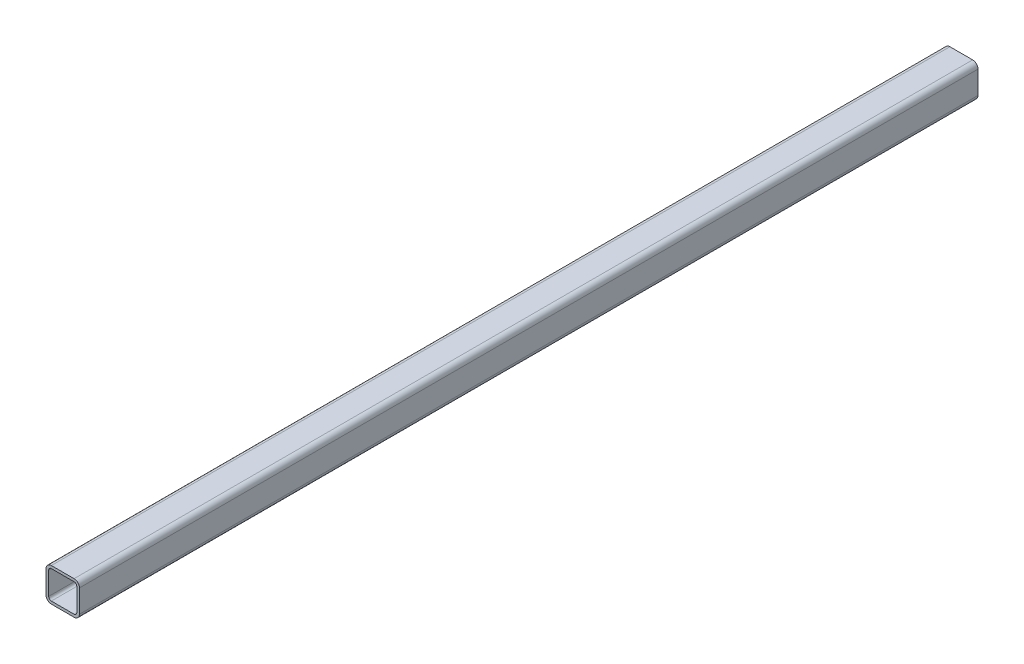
ISO-10303-21;
HEADER;
FILE_DESCRIPTION(('STEP AP214'),'2;1');
FILE_NAME('part.step','',(''),(''),'','','');
FILE_SCHEMA(('AUTOMOTIVE_DESIGN { 1 0 10303 214 1 1 1 1 }'));
ENDSEC;
DATA;
#1=APPLICATION_CONTEXT('core data for automotive mechanical design processes');
#2=APPLICATION_PROTOCOL_DEFINITION('international standard','automotive_design',2000,#1);
#3=PRODUCT_CONTEXT('',#1,'mechanical');
#4=PRODUCT('Part','Part','',(#3));
#5=PRODUCT_RELATED_PRODUCT_CATEGORY('part','',(#4));
#6=PRODUCT_DEFINITION_FORMATION('','',#4);
#7=PRODUCT_DEFINITION_CONTEXT('part definition',#1,'design');
#8=PRODUCT_DEFINITION('design','',#6,#7);
#9=PRODUCT_DEFINITION_SHAPE('','',#8);
#10=(LENGTH_UNIT() NAMED_UNIT(*) SI_UNIT(.MILLI.,.METRE.));
#11=(NAMED_UNIT(*) PLANE_ANGLE_UNIT() SI_UNIT($,.RADIAN.));
#12=(NAMED_UNIT(*) SI_UNIT($,.STERADIAN.) SOLID_ANGLE_UNIT());
#13=UNCERTAINTY_MEASURE_WITH_UNIT(LENGTH_MEASURE(1.E-05),#10,'distance_accuracy_value','');
#14=(GEOMETRIC_REPRESENTATION_CONTEXT(3) GLOBAL_UNCERTAINTY_ASSIGNED_CONTEXT((#13)) GLOBAL_UNIT_ASSIGNED_CONTEXT((#10,
#11,#12)) REPRESENTATION_CONTEXT('',''));
#15=CARTESIAN_POINT('',(0.,0.,0.));
#16=DIRECTION('',(0.,0.,1.));
#17=DIRECTION('',(1.,0.,0.));
#18=AXIS2_PLACEMENT_3D('',#15,#16,#17);
#19=CARTESIAN_POINT('',(-12.97432,12.97432,511.96875));
#20=DIRECTION('',(0.,0.,1.));
#21=DIRECTION('',(1.,0.,0.));
#22=AXIS2_PLACEMENT_3D('',#19,#20,#21);
#23=PLANE('',#22);
#24=CARTESIAN_POINT('',(-12.97432,12.97432,511.96875));
#25=DIRECTION('',(0.,0.,1.));
#26=DIRECTION('',(-1.,0.,0.));
#27=AXIS2_PLACEMENT_3D('',#24,#25,#26);
#28=CIRCLE('',#27,6.07568);
#29=CARTESIAN_POINT('',(-12.97432,19.05,511.96875));
#30=VERTEX_POINT('',#29);
#31=CARTESIAN_POINT('',(-19.05,12.97432,511.96875));
#32=VERTEX_POINT('',#31);
#33=EDGE_CURVE('E260',#30,#32,#28,.T.);
#34=ORIENTED_EDGE('',*,*,#33,.T.);
#35=DIRECTION('',(0.,-1.,0.));
#36=VECTOR('',#35,1.);
#37=CARTESIAN_POINT('',(-19.05,12.97432,511.96875));
#38=LINE('',#37,#36);
#39=CARTESIAN_POINT('',(-19.05,-12.97432,511.96875));
#40=VERTEX_POINT('',#39);
#41=EDGE_CURVE('E263',#32,#40,#38,.T.);
#42=ORIENTED_EDGE('',*,*,#41,.T.);
#43=CARTESIAN_POINT('',(-12.97432,-12.97432,511.96875));
#44=DIRECTION('',(0.,0.,1.));
#45=DIRECTION('',(-1.,0.,0.));
#46=AXIS2_PLACEMENT_3D('',#43,#44,#45);
#47=CIRCLE('',#46,6.07568);
#48=CARTESIAN_POINT('',(-12.97432,-19.05,511.96875));
#49=VERTEX_POINT('',#48);
#50=EDGE_CURVE('E266',#40,#49,#47,.T.);
#51=ORIENTED_EDGE('',*,*,#50,.T.);
#52=DIRECTION('',(1.,0.,0.));
#53=VECTOR('',#52,1.);
#54=CARTESIAN_POINT('',(-12.97432,-19.05,511.96875));
#55=LINE('',#54,#53);
#56=CARTESIAN_POINT('',(12.97432,-19.05,511.96875));
#57=VERTEX_POINT('',#56);
#58=EDGE_CURVE('E268',#49,#57,#55,.T.);
#59=ORIENTED_EDGE('',*,*,#58,.T.);
#60=CARTESIAN_POINT('',(12.97432,-12.97432,511.96875));
#61=DIRECTION('',(0.,0.,1.));
#62=DIRECTION('',(1.,0.,0.));
#63=AXIS2_PLACEMENT_3D('',#60,#61,#62);
#64=CIRCLE('',#63,6.07568);
#65=CARTESIAN_POINT('',(19.05,-12.97432,511.96875));
#66=VERTEX_POINT('',#65);
#67=EDGE_CURVE('E270',#57,#66,#64,.T.);
#68=ORIENTED_EDGE('',*,*,#67,.T.);
#69=DIRECTION('',(0.,1.,0.));
#70=VECTOR('',#69,1.);
#71=CARTESIAN_POINT('',(19.05,12.97432,511.96875));
#72=LINE('',#71,#70);
#73=CARTESIAN_POINT('',(19.05,12.97432,511.96875));
#74=VERTEX_POINT('',#73);
#75=EDGE_CURVE('E272',#66,#74,#72,.T.);
#76=ORIENTED_EDGE('',*,*,#75,.T.);
#77=CARTESIAN_POINT('',(12.97432,12.97432,511.96875));
#78=DIRECTION('',(0.,0.,1.));
#79=DIRECTION('',(1.,0.,0.));
#80=AXIS2_PLACEMENT_3D('',#77,#78,#79);
#81=CIRCLE('',#80,6.07568);
#82=CARTESIAN_POINT('',(12.97432,19.05,511.96875));
#83=VERTEX_POINT('',#82);
#84=EDGE_CURVE('E274',#74,#83,#81,.T.);
#85=ORIENTED_EDGE('',*,*,#84,.T.);
#86=DIRECTION('',(-1.,0.,0.));
#87=VECTOR('',#86,1.);
#88=CARTESIAN_POINT('',(-12.97432,19.05,511.96875));
#89=LINE('',#88,#87);
#90=EDGE_CURVE('E276',#83,#30,#89,.T.);
#91=ORIENTED_EDGE('',*,*,#90,.T.);
#92=EDGE_LOOP('',(#34,#42,#51,#59,#68,#76,#85,#91));
#93=FACE_BOUND('',#92,.T.);
#94=DIRECTION('',(0.,-1.,0.));
#95=VECTOR('',#94,1.);
#96=CARTESIAN_POINT('',(-16.01216,12.97432,511.96875));
#97=LINE('',#96,#95);
#98=CARTESIAN_POINT('',(-16.01216,12.97432,511.96875));
#99=VERTEX_POINT('',#98);
#100=CARTESIAN_POINT('',(-16.01216,-12.97432,511.96875));
#101=VERTEX_POINT('',#100);
#102=EDGE_CURVE('E203',#99,#101,#97,.T.);
#103=ORIENTED_EDGE('',*,*,#102,.F.);
#104=CARTESIAN_POINT('',(-12.97432,12.97432,511.96875));
#105=DIRECTION('',(0.,0.,-1.));
#106=DIRECTION('',(-1.,0.,0.));
#107=AXIS2_PLACEMENT_3D('',#104,#105,#106);
#108=CIRCLE('',#107,3.03784);
#109=CARTESIAN_POINT('',(-12.97432,16.01216,511.96875));
#110=VERTEX_POINT('',#109);
#111=EDGE_CURVE('E195',#110,#99,#108,.F.);
#112=ORIENTED_EDGE('',*,*,#111,.F.);
#113=DIRECTION('',(-1.,0.,0.));
#114=VECTOR('',#113,1.);
#115=CARTESIAN_POINT('',(-12.97432,16.01216,511.96875));
#116=LINE('',#115,#114);
#117=CARTESIAN_POINT('',(12.97432,16.01216,511.96875));
#118=VERTEX_POINT('',#117);
#119=EDGE_CURVE('E228',#118,#110,#116,.T.);
#120=ORIENTED_EDGE('',*,*,#119,.F.);
#121=CARTESIAN_POINT('',(12.97432,12.97432,511.96875));
#122=DIRECTION('',(0.,0.,-1.));
#123=DIRECTION('',(-1.,0.,0.));
#124=AXIS2_PLACEMENT_3D('',#121,#122,#123);
#125=CIRCLE('',#124,3.03784);
#126=CARTESIAN_POINT('',(16.01216,12.97432,511.96875));
#127=VERTEX_POINT('',#126);
#128=EDGE_CURVE('E226',#127,#118,#125,.F.);
#129=ORIENTED_EDGE('',*,*,#128,.F.);
#130=DIRECTION('',(0.,1.,0.));
#131=VECTOR('',#130,1.);
#132=CARTESIAN_POINT('',(16.01216,12.97432,511.96875));
#133=LINE('',#132,#131);
#134=CARTESIAN_POINT('',(16.01216,-12.97432,511.96875));
#135=VERTEX_POINT('',#134);
#136=EDGE_CURVE('E224',#135,#127,#133,.T.);
#137=ORIENTED_EDGE('',*,*,#136,.F.);
#138=CARTESIAN_POINT('',(12.97432,-12.97432,511.96875));
#139=DIRECTION('',(0.,0.,-1.));
#140=DIRECTION('',(-1.,0.,0.));
#141=AXIS2_PLACEMENT_3D('',#138,#139,#140);
#142=CIRCLE('',#141,3.03784);
#143=CARTESIAN_POINT('',(12.97432,-16.01216,511.96875));
#144=VERTEX_POINT('',#143);
#145=EDGE_CURVE('E222',#144,#135,#142,.F.);
#146=ORIENTED_EDGE('',*,*,#145,.F.);
#147=DIRECTION('',(1.,0.,0.));
#148=VECTOR('',#147,1.);
#149=CARTESIAN_POINT('',(-12.97432,-16.01216,511.96875));
#150=LINE('',#149,#148);
#151=CARTESIAN_POINT('',(-12.97432,-16.01216,511.96875));
#152=VERTEX_POINT('',#151);
#153=EDGE_CURVE('E218',#152,#144,#150,.T.);
#154=ORIENTED_EDGE('',*,*,#153,.F.);
#155=CARTESIAN_POINT('',(-12.97432,-12.97432,511.96875));
#156=DIRECTION('',(0.,0.,-1.));
#157=DIRECTION('',(-1.,0.,0.));
#158=AXIS2_PLACEMENT_3D('',#155,#156,#157);
#159=CIRCLE('',#158,3.03784);
#160=EDGE_CURVE('E216',#101,#152,#159,.F.);
#161=ORIENTED_EDGE('',*,*,#160,.F.);
#162=EDGE_LOOP('',(#103,#112,#120,#129,#137,#146,#154,#161));
#163=FACE_BOUND('',#162,.T.);
#164=ADVANCED_FACE('F82',(#93,#163),#23,.T.);
#165=CARTESIAN_POINT('',(-12.97432,12.97432,-511.96875));
#166=DIRECTION('',(0.,0.,1.));
#167=DIRECTION('',(1.,0.,0.));
#168=AXIS2_PLACEMENT_3D('',#165,#166,#167);
#169=PLANE('',#168);
#170=CARTESIAN_POINT('',(-12.97432,12.97432,-511.96875));
#171=DIRECTION('',(0.,0.,1.));
#172=DIRECTION('',(-1.,0.,0.));
#173=AXIS2_PLACEMENT_3D('',#170,#171,#172);
#174=CIRCLE('',#173,6.07568);
#175=CARTESIAN_POINT('',(-12.97432,19.05,-511.96875));
#176=VERTEX_POINT('',#175);
#177=CARTESIAN_POINT('',(-19.05,12.97432,-511.96875));
#178=VERTEX_POINT('',#177);
#179=EDGE_CURVE('E211',#176,#178,#174,.T.);
#180=ORIENTED_EDGE('',*,*,#179,.F.);
#181=DIRECTION('',(-1.,0.,0.));
#182=VECTOR('',#181,1.);
#183=CARTESIAN_POINT('',(-12.97432,19.05,-511.96875));
#184=LINE('',#183,#182);
#185=CARTESIAN_POINT('',(12.97432,19.05,-511.96875));
#186=VERTEX_POINT('',#185);
#187=EDGE_CURVE('E264',#186,#176,#184,.T.);
#188=ORIENTED_EDGE('',*,*,#187,.F.);
#189=CARTESIAN_POINT('',(12.97432,12.97432,-511.96875));
#190=DIRECTION('',(0.,0.,1.));
#191=DIRECTION('',(1.,0.,0.));
#192=AXIS2_PLACEMENT_3D('',#189,#190,#191);
#193=CIRCLE('',#192,6.07568);
#194=CARTESIAN_POINT('',(19.05,12.97432,-511.96875));
#195=VERTEX_POINT('',#194);
#196=EDGE_CURVE('E291',#195,#186,#193,.T.);
#197=ORIENTED_EDGE('',*,*,#196,.F.);
#198=DIRECTION('',(0.,1.,0.));
#199=VECTOR('',#198,1.);
#200=CARTESIAN_POINT('',(19.05,12.97432,-511.96875));
#201=LINE('',#200,#199);
#202=CARTESIAN_POINT('',(19.05,-12.97432,-511.96875));
#203=VERTEX_POINT('',#202);
#204=EDGE_CURVE('E289',#203,#195,#201,.T.);
#205=ORIENTED_EDGE('',*,*,#204,.F.);
#206=CARTESIAN_POINT('',(12.97432,-12.97432,-511.96875));
#207=DIRECTION('',(0.,0.,1.));
#208=DIRECTION('',(1.,0.,0.));
#209=AXIS2_PLACEMENT_3D('',#206,#207,#208);
#210=CIRCLE('',#209,6.07568);
#211=CARTESIAN_POINT('',(12.97432,-19.05,-511.96875));
#212=VERTEX_POINT('',#211);
#213=EDGE_CURVE('E287',#212,#203,#210,.T.);
#214=ORIENTED_EDGE('',*,*,#213,.F.);
#215=DIRECTION('',(1.,0.,0.));
#216=VECTOR('',#215,1.);
#217=CARTESIAN_POINT('',(-12.97432,-19.05,-511.96875));
#218=LINE('',#217,#216);
#219=CARTESIAN_POINT('',(-12.97432,-19.05,-511.96875));
#220=VERTEX_POINT('',#219);
#221=EDGE_CURVE('E285',#220,#212,#218,.T.);
#222=ORIENTED_EDGE('',*,*,#221,.F.);
#223=CARTESIAN_POINT('',(-12.97432,-12.97432,-511.96875));
#224=DIRECTION('',(0.,0.,1.));
#225=DIRECTION('',(-1.,0.,0.));
#226=AXIS2_PLACEMENT_3D('',#223,#224,#225);
#227=CIRCLE('',#226,6.07568);
#228=CARTESIAN_POINT('',(-19.05,-12.97432,-511.96875));
#229=VERTEX_POINT('',#228);
#230=EDGE_CURVE('E283',#229,#220,#227,.T.);
#231=ORIENTED_EDGE('',*,*,#230,.F.);
#232=DIRECTION('',(0.,-1.,0.));
#233=VECTOR('',#232,1.);
#234=CARTESIAN_POINT('',(-19.05,12.97432,-511.96875));
#235=LINE('',#234,#233);
#236=EDGE_CURVE('E281',#178,#229,#235,.T.);
#237=ORIENTED_EDGE('',*,*,#236,.F.);
#238=EDGE_LOOP('',(#180,#188,#197,#205,#214,#222,#231,#237));
#239=FACE_BOUND('',#238,.T.);
#240=CARTESIAN_POINT('',(-12.97432,12.97432,-511.96875));
#241=DIRECTION('',(0.,0.,-1.));
#242=DIRECTION('',(-1.,0.,0.));
#243=AXIS2_PLACEMENT_3D('',#240,#241,#242);
#244=CIRCLE('',#243,3.03784);
#245=CARTESIAN_POINT('',(-12.97432,16.01216,-511.96875));
#246=VERTEX_POINT('',#245);
#247=CARTESIAN_POINT('',(-16.01216,12.97432,-511.96875));
#248=VERTEX_POINT('',#247);
#249=EDGE_CURVE('E105',#246,#248,#244,.F.);
#250=ORIENTED_EDGE('',*,*,#249,.T.);
#251=DIRECTION('',(0.,-1.,0.));
#252=VECTOR('',#251,1.);
#253=CARTESIAN_POINT('',(-16.01216,12.97432,-511.96875));
#254=LINE('',#253,#252);
#255=CARTESIAN_POINT('',(-16.01216,-12.97432,-511.96875));
#256=VERTEX_POINT('',#255);
#257=EDGE_CURVE('E210',#248,#256,#254,.T.);
#258=ORIENTED_EDGE('',*,*,#257,.T.);
#259=CARTESIAN_POINT('',(-12.97432,-12.97432,-511.96875));
#260=DIRECTION('',(0.,0.,-1.));
#261=DIRECTION('',(-1.,0.,0.));
#262=AXIS2_PLACEMENT_3D('',#259,#260,#261);
#263=CIRCLE('',#262,3.03784);
#264=CARTESIAN_POINT('',(-12.97432,-16.01216,-511.96875));
#265=VERTEX_POINT('',#264);
#266=EDGE_CURVE('E232',#256,#265,#263,.F.);
#267=ORIENTED_EDGE('',*,*,#266,.T.);
#268=DIRECTION('',(1.,0.,0.));
#269=VECTOR('',#268,1.);
#270=CARTESIAN_POINT('',(-12.97432,-16.01216,-511.96875));
#271=LINE('',#270,#269);
#272=CARTESIAN_POINT('',(12.97432,-16.01216,-511.96875));
#273=VERTEX_POINT('',#272);
#274=EDGE_CURVE('E235',#265,#273,#271,.T.);
#275=ORIENTED_EDGE('',*,*,#274,.T.);
#276=CARTESIAN_POINT('',(12.97432,-12.97432,-511.96875));
#277=DIRECTION('',(0.,0.,-1.));
#278=DIRECTION('',(-1.,0.,0.));
#279=AXIS2_PLACEMENT_3D('',#276,#277,#278);
#280=CIRCLE('',#279,3.03784);
#281=CARTESIAN_POINT('',(16.01216,-12.97432,-511.96875));
#282=VERTEX_POINT('',#281);
#283=EDGE_CURVE('E238',#273,#282,#280,.F.);
#284=ORIENTED_EDGE('',*,*,#283,.T.);
#285=DIRECTION('',(0.,1.,0.));
#286=VECTOR('',#285,1.);
#287=CARTESIAN_POINT('',(16.01216,12.97432,-511.96875));
#288=LINE('',#287,#286);
#289=CARTESIAN_POINT('',(16.01216,12.97432,-511.96875));
#290=VERTEX_POINT('',#289);
#291=EDGE_CURVE('E241',#282,#290,#288,.T.);
#292=ORIENTED_EDGE('',*,*,#291,.T.);
#293=CARTESIAN_POINT('',(12.97432,12.97432,-511.96875));
#294=DIRECTION('',(0.,0.,-1.));
#295=DIRECTION('',(-1.,0.,0.));
#296=AXIS2_PLACEMENT_3D('',#293,#294,#295);
#297=CIRCLE('',#296,3.03784);
#298=CARTESIAN_POINT('',(12.97432,16.01216,-511.96875));
#299=VERTEX_POINT('',#298);
#300=EDGE_CURVE('E244',#290,#299,#297,.F.);
#301=ORIENTED_EDGE('',*,*,#300,.T.);
#302=DIRECTION('',(-1.,0.,0.));
#303=VECTOR('',#302,1.);
#304=CARTESIAN_POINT('',(-12.97432,16.01216,-511.96875));
#305=LINE('',#304,#303);
#306=EDGE_CURVE('E204',#299,#246,#305,.T.);
#307=ORIENTED_EDGE('',*,*,#306,.T.);
#308=EDGE_LOOP('',(#250,#258,#267,#275,#284,#292,#301,#307));
#309=FACE_BOUND('',#308,.T.);
#310=ADVANCED_FACE('F321',(#239,#309),#169,.F.);
#311=CARTESIAN_POINT('',(-12.97432,12.97432,511.96875));
#312=DIRECTION('',(0.,0.,-1.));
#313=DIRECTION('',(-1.,0.,0.));
#314=AXIS2_PLACEMENT_3D('',#311,#312,#313);
#315=CYLINDRICAL_SURFACE('',#314,6.07568);
#316=ORIENTED_EDGE('',*,*,#179,.T.);
#317=DIRECTION('',(0.,0.,-1.));
#318=VECTOR('',#317,1.);
#319=CARTESIAN_POINT('',(-19.05,12.97432,511.96875));
#320=LINE('',#319,#318);
#321=EDGE_CURVE('E12',#32,#178,#320,.T.);
#322=ORIENTED_EDGE('',*,*,#321,.F.);
#323=ORIENTED_EDGE('',*,*,#33,.F.);
#324=DIRECTION('',(0.,0.,-1.));
#325=VECTOR('',#324,1.);
#326=CARTESIAN_POINT('',(-12.97432,19.05,511.96875));
#327=LINE('',#326,#325);
#328=EDGE_CURVE('E278',#30,#176,#327,.T.);
#329=ORIENTED_EDGE('',*,*,#328,.T.);
#330=EDGE_LOOP('',(#316,#322,#323,#329));
#331=FACE_BOUND('',#330,.T.);
#332=ADVANCED_FACE('F84',(#331),#315,.T.);
#333=CARTESIAN_POINT('',(-19.05,12.97432,511.96875));
#334=DIRECTION('',(1.,0.,0.));
#335=DIRECTION('',(0.,1.,0.));
#336=AXIS2_PLACEMENT_3D('',#333,#334,#335);
#337=PLANE('',#336);
#338=ORIENTED_EDGE('',*,*,#236,.T.);
#339=DIRECTION('',(0.,0.,-1.));
#340=VECTOR('',#339,1.);
#341=CARTESIAN_POINT('',(-19.05,-12.97432,511.96875));
#342=LINE('',#341,#340);
#343=EDGE_CURVE('E90',#40,#229,#342,.T.);
#344=ORIENTED_EDGE('',*,*,#343,.F.);
#345=ORIENTED_EDGE('',*,*,#41,.F.);
#346=ORIENTED_EDGE('',*,*,#321,.T.);
#347=EDGE_LOOP('',(#338,#344,#345,#346));
#348=FACE_BOUND('',#347,.T.);
#349=ADVANCED_FACE('F338',(#348),#337,.F.);
#350=CARTESIAN_POINT('',(-12.97432,-12.97432,511.96875));
#351=DIRECTION('',(0.,0.,-1.));
#352=DIRECTION('',(-1.,0.,0.));
#353=AXIS2_PLACEMENT_3D('',#350,#351,#352);
#354=CYLINDRICAL_SURFACE('',#353,6.07568);
#355=ORIENTED_EDGE('',*,*,#230,.T.);
#356=DIRECTION('',(0.,0.,-1.));
#357=VECTOR('',#356,1.);
#358=CARTESIAN_POINT('',(-12.97432,-19.05,511.96875));
#359=LINE('',#358,#357);
#360=EDGE_CURVE('E308',#49,#220,#359,.T.);
#361=ORIENTED_EDGE('',*,*,#360,.F.);
#362=ORIENTED_EDGE('',*,*,#50,.F.);
#363=ORIENTED_EDGE('',*,*,#343,.T.);
#364=EDGE_LOOP('',(#355,#361,#362,#363));
#365=FACE_BOUND('',#364,.T.);
#366=ADVANCED_FACE('F315',(#365),#354,.T.);
#367=CARTESIAN_POINT('',(-12.97432,-19.05,511.96875));
#368=DIRECTION('',(0.,1.,0.));
#369=DIRECTION('',(0.,0.,1.));
#370=AXIS2_PLACEMENT_3D('',#367,#368,#369);
#371=PLANE('',#370);
#372=ORIENTED_EDGE('',*,*,#221,.T.);
#373=DIRECTION('',(0.,0.,-1.));
#374=VECTOR('',#373,1.);
#375=CARTESIAN_POINT('',(12.97432,-19.05,511.96875));
#376=LINE('',#375,#374);
#377=EDGE_CURVE('E305',#57,#212,#376,.T.);
#378=ORIENTED_EDGE('',*,*,#377,.F.);
#379=ORIENTED_EDGE('',*,*,#58,.F.);
#380=ORIENTED_EDGE('',*,*,#360,.T.);
#381=EDGE_LOOP('',(#372,#378,#379,#380));
#382=FACE_BOUND('',#381,.T.);
#383=ADVANCED_FACE('F327',(#382),#371,.F.);
#384=CARTESIAN_POINT('',(12.97432,-12.97432,511.96875));
#385=DIRECTION('',(0.,0.,-1.));
#386=DIRECTION('',(-1.,0.,0.));
#387=AXIS2_PLACEMENT_3D('',#384,#385,#386);
#388=CYLINDRICAL_SURFACE('',#387,6.07568);
#389=ORIENTED_EDGE('',*,*,#213,.T.);
#390=DIRECTION('',(0.,0.,-1.));
#391=VECTOR('',#390,1.);
#392=CARTESIAN_POINT('',(19.05,-12.97432,511.96875));
#393=LINE('',#392,#391);
#394=EDGE_CURVE('E302',#66,#203,#393,.T.);
#395=ORIENTED_EDGE('',*,*,#394,.F.);
#396=ORIENTED_EDGE('',*,*,#67,.F.);
#397=ORIENTED_EDGE('',*,*,#377,.T.);
#398=EDGE_LOOP('',(#389,#395,#396,#397));
#399=FACE_BOUND('',#398,.T.);
#400=ADVANCED_FACE('F331',(#399),#388,.T.);
#401=CARTESIAN_POINT('',(19.05,12.97432,511.96875));
#402=DIRECTION('',(-1.,0.,0.));
#403=DIRECTION('',(0.,-1.,0.));
#404=AXIS2_PLACEMENT_3D('',#401,#402,#403);
#405=PLANE('',#404);
#406=ORIENTED_EDGE('',*,*,#204,.T.);
#407=DIRECTION('',(0.,0.,-1.));
#408=VECTOR('',#407,1.);
#409=CARTESIAN_POINT('',(19.05,12.97432,511.96875));
#410=LINE('',#409,#408);
#411=EDGE_CURVE('E299',#74,#195,#410,.T.);
#412=ORIENTED_EDGE('',*,*,#411,.F.);
#413=ORIENTED_EDGE('',*,*,#75,.F.);
#414=ORIENTED_EDGE('',*,*,#394,.T.);
#415=EDGE_LOOP('',(#406,#412,#413,#414));
#416=FACE_BOUND('',#415,.T.);
#417=ADVANCED_FACE('F351',(#416),#405,.F.);
#418=CARTESIAN_POINT('',(12.97432,12.97432,511.96875));
#419=DIRECTION('',(0.,0.,-1.));
#420=DIRECTION('',(-1.,0.,0.));
#421=AXIS2_PLACEMENT_3D('',#418,#419,#420);
#422=CYLINDRICAL_SURFACE('',#421,6.07568);
#423=ORIENTED_EDGE('',*,*,#196,.T.);
#424=DIRECTION('',(0.,0.,-1.));
#425=VECTOR('',#424,1.);
#426=CARTESIAN_POINT('',(12.97432,19.05,511.96875));
#427=LINE('',#426,#425);
#428=EDGE_CURVE('E296',#83,#186,#427,.T.);
#429=ORIENTED_EDGE('',*,*,#428,.F.);
#430=ORIENTED_EDGE('',*,*,#84,.F.);
#431=ORIENTED_EDGE('',*,*,#411,.T.);
#432=EDGE_LOOP('',(#423,#429,#430,#431));
#433=FACE_BOUND('',#432,.T.);
#434=ADVANCED_FACE('F349',(#433),#422,.T.);
#435=CARTESIAN_POINT('',(-12.97432,19.05,511.96875));
#436=DIRECTION('',(0.,-1.,0.));
#437=DIRECTION('',(0.,0.,-1.));
#438=AXIS2_PLACEMENT_3D('',#435,#436,#437);
#439=PLANE('',#438);
#440=ORIENTED_EDGE('',*,*,#187,.T.);
#441=ORIENTED_EDGE('',*,*,#328,.F.);
#442=ORIENTED_EDGE('',*,*,#90,.F.);
#443=ORIENTED_EDGE('',*,*,#428,.T.);
#444=EDGE_LOOP('',(#440,#441,#442,#443));
#445=FACE_BOUND('',#444,.T.);
#446=ADVANCED_FACE('F344',(#445),#439,.F.);
#447=CARTESIAN_POINT('',(-12.97432,12.97432,511.96875));
#448=DIRECTION('',(0.,0.,-1.));
#449=DIRECTION('',(-1.,0.,0.));
#450=AXIS2_PLACEMENT_3D('',#447,#448,#449);
#451=CYLINDRICAL_SURFACE('',#450,3.03784);
#452=ORIENTED_EDGE('',*,*,#249,.F.);
#453=DIRECTION('',(0.,0.,-1.));
#454=VECTOR('',#453,1.);
#455=CARTESIAN_POINT('',(-12.97432,16.01216,511.96875));
#456=LINE('',#455,#454);
#457=EDGE_CURVE('E199',#110,#246,#456,.T.);
#458=ORIENTED_EDGE('',*,*,#457,.F.);
#459=ORIENTED_EDGE('',*,*,#111,.T.);
#460=DIRECTION('',(0.,0.,-1.));
#461=VECTOR('',#460,1.);
#462=CARTESIAN_POINT('',(-16.01216,12.97432,511.96875));
#463=LINE('',#462,#461);
#464=EDGE_CURVE('E198',#99,#248,#463,.T.);
#465=ORIENTED_EDGE('',*,*,#464,.T.);
#466=EDGE_LOOP('',(#452,#458,#459,#465));
#467=FACE_BOUND('',#466,.T.);
#468=ADVANCED_FACE('F197',(#467),#451,.F.);
#469=CARTESIAN_POINT('',(-16.01216,12.97432,511.96875));
#470=DIRECTION('',(1.,0.,0.));
#471=DIRECTION('',(0.,1.,0.));
#472=AXIS2_PLACEMENT_3D('',#469,#470,#471);
#473=PLANE('',#472);
#474=ORIENTED_EDGE('',*,*,#257,.F.);
#475=ORIENTED_EDGE('',*,*,#464,.F.);
#476=ORIENTED_EDGE('',*,*,#102,.T.);
#477=DIRECTION('',(0.,0.,-1.));
#478=VECTOR('',#477,1.);
#479=CARTESIAN_POINT('',(-16.01216,-12.97432,511.96875));
#480=LINE('',#479,#478);
#481=EDGE_CURVE('E212',#101,#256,#480,.T.);
#482=ORIENTED_EDGE('',*,*,#481,.T.);
#483=EDGE_LOOP('',(#474,#475,#476,#482));
#484=FACE_BOUND('',#483,.T.);
#485=ADVANCED_FACE('F207',(#484),#473,.T.);
#486=CARTESIAN_POINT('',(-12.97432,-12.97432,511.96875));
#487=DIRECTION('',(0.,0.,-1.));
#488=DIRECTION('',(-1.,0.,0.));
#489=AXIS2_PLACEMENT_3D('',#486,#487,#488);
#490=CYLINDRICAL_SURFACE('',#489,3.03784);
#491=ORIENTED_EDGE('',*,*,#266,.F.);
#492=ORIENTED_EDGE('',*,*,#481,.F.);
#493=ORIENTED_EDGE('',*,*,#160,.T.);
#494=DIRECTION('',(0.,0.,-1.));
#495=VECTOR('',#494,1.);
#496=CARTESIAN_POINT('',(-12.97432,-16.01216,511.96875));
#497=LINE('',#496,#495);
#498=EDGE_CURVE('E257',#152,#265,#497,.T.);
#499=ORIENTED_EDGE('',*,*,#498,.T.);
#500=EDGE_LOOP('',(#491,#492,#493,#499));
#501=FACE_BOUND('',#500,.T.);
#502=ADVANCED_FACE('F376',(#501),#490,.F.);
#503=CARTESIAN_POINT('',(-12.97432,-16.01216,511.96875));
#504=DIRECTION('',(0.,1.,0.));
#505=DIRECTION('',(0.,0.,1.));
#506=AXIS2_PLACEMENT_3D('',#503,#504,#505);
#507=PLANE('',#506);
#508=ORIENTED_EDGE('',*,*,#274,.F.);
#509=ORIENTED_EDGE('',*,*,#498,.F.);
#510=ORIENTED_EDGE('',*,*,#153,.T.);
#511=DIRECTION('',(0.,0.,-1.));
#512=VECTOR('',#511,1.);
#513=CARTESIAN_POINT('',(12.97432,-16.01216,511.96875));
#514=LINE('',#513,#512);
#515=EDGE_CURVE('E255',#144,#273,#514,.T.);
#516=ORIENTED_EDGE('',*,*,#515,.T.);
#517=EDGE_LOOP('',(#508,#509,#510,#516));
#518=FACE_BOUND('',#517,.T.);
#519=ADVANCED_FACE('F380',(#518),#507,.T.);
#520=CARTESIAN_POINT('',(12.97432,-12.97432,511.96875));
#521=DIRECTION('',(0.,0.,-1.));
#522=DIRECTION('',(-1.,0.,0.));
#523=AXIS2_PLACEMENT_3D('',#520,#521,#522);
#524=CYLINDRICAL_SURFACE('',#523,3.03784);
#525=ORIENTED_EDGE('',*,*,#283,.F.);
#526=ORIENTED_EDGE('',*,*,#515,.F.);
#527=ORIENTED_EDGE('',*,*,#145,.T.);
#528=DIRECTION('',(0.,0.,-1.));
#529=VECTOR('',#528,1.);
#530=CARTESIAN_POINT('',(16.01216,-12.97432,511.96875));
#531=LINE('',#530,#529);
#532=EDGE_CURVE('E253',#135,#282,#531,.T.);
#533=ORIENTED_EDGE('',*,*,#532,.T.);
#534=EDGE_LOOP('',(#525,#526,#527,#533));
#535=FACE_BOUND('',#534,.T.);
#536=ADVANCED_FACE('F386',(#535),#524,.F.);
#537=CARTESIAN_POINT('',(16.01216,12.97432,511.96875));
#538=DIRECTION('',(-1.,0.,0.));
#539=DIRECTION('',(0.,-1.,0.));
#540=AXIS2_PLACEMENT_3D('',#537,#538,#539);
#541=PLANE('',#540);
#542=ORIENTED_EDGE('',*,*,#291,.F.);
#543=ORIENTED_EDGE('',*,*,#532,.F.);
#544=ORIENTED_EDGE('',*,*,#136,.T.);
#545=DIRECTION('',(0.,0.,-1.));
#546=VECTOR('',#545,1.);
#547=CARTESIAN_POINT('',(16.01216,12.97432,511.96875));
#548=LINE('',#547,#546);
#549=EDGE_CURVE('E251',#127,#290,#548,.T.);
#550=ORIENTED_EDGE('',*,*,#549,.T.);
#551=EDGE_LOOP('',(#542,#543,#544,#550));
#552=FACE_BOUND('',#551,.T.);
#553=ADVANCED_FACE('F390',(#552),#541,.T.);
#554=CARTESIAN_POINT('',(12.97432,12.97432,511.96875));
#555=DIRECTION('',(0.,0.,-1.));
#556=DIRECTION('',(-1.,0.,0.));
#557=AXIS2_PLACEMENT_3D('',#554,#555,#556);
#558=CYLINDRICAL_SURFACE('',#557,3.03784);
#559=ORIENTED_EDGE('',*,*,#300,.F.);
#560=ORIENTED_EDGE('',*,*,#549,.F.);
#561=ORIENTED_EDGE('',*,*,#128,.T.);
#562=DIRECTION('',(0.,0.,-1.));
#563=VECTOR('',#562,1.);
#564=CARTESIAN_POINT('',(12.97432,16.01216,511.96875));
#565=LINE('',#564,#563);
#566=EDGE_CURVE('E97',#118,#299,#565,.T.);
#567=ORIENTED_EDGE('',*,*,#566,.T.);
#568=EDGE_LOOP('',(#559,#560,#561,#567));
#569=FACE_BOUND('',#568,.T.);
#570=ADVANCED_FACE('F394',(#569),#558,.F.);
#571=CARTESIAN_POINT('',(-12.97432,16.01216,511.96875));
#572=DIRECTION('',(0.,-1.,0.));
#573=DIRECTION('',(0.,0.,-1.));
#574=AXIS2_PLACEMENT_3D('',#571,#572,#573);
#575=PLANE('',#574);
#576=ORIENTED_EDGE('',*,*,#306,.F.);
#577=ORIENTED_EDGE('',*,*,#566,.F.);
#578=ORIENTED_EDGE('',*,*,#119,.T.);
#579=ORIENTED_EDGE('',*,*,#457,.T.);
#580=EDGE_LOOP('',(#576,#577,#578,#579));
#581=FACE_BOUND('',#580,.T.);
#582=ADVANCED_FACE('F398',(#581),#575,.T.);
#583=CLOSED_SHELL('',(#164,#310,#332,#349,#366,#383,#400,#417,#434,#446,#468,#485,#502,#519,
#536,#553,#570,#582));
#584=MANIFOLD_SOLID_BREP('B2',#583);
#585=ADVANCED_BREP_SHAPE_REPRESENTATION('',(#18,#584),#14);
#586=SHAPE_DEFINITION_REPRESENTATION(#9,#585);
ENDSEC;
END-ISO-10303-21;
